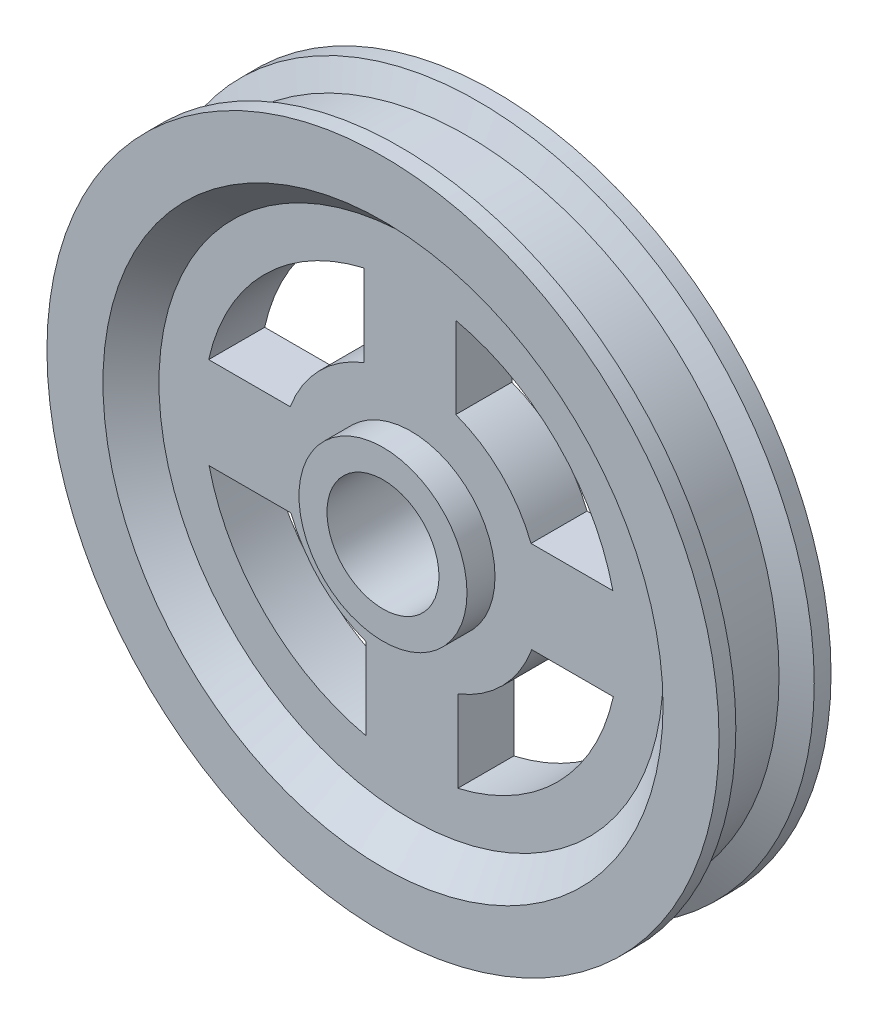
ISO-10303-21;
HEADER;
FILE_DESCRIPTION(('STEP AP214'),'2;1');
FILE_NAME('part.step','',(''),(''),'','','');
FILE_SCHEMA(('AUTOMOTIVE_DESIGN { 1 0 10303 214 1 1 1 1 }'));
ENDSEC;
DATA;
#1=APPLICATION_CONTEXT('core data for automotive mechanical design processes');
#2=APPLICATION_PROTOCOL_DEFINITION('international standard','automotive_design',2000,#1);
#3=PRODUCT_CONTEXT('',#1,'mechanical');
#4=PRODUCT('Part','Part','',(#3));
#5=PRODUCT_RELATED_PRODUCT_CATEGORY('part','',(#4));
#6=PRODUCT_DEFINITION_FORMATION('','',#4);
#7=PRODUCT_DEFINITION_CONTEXT('part definition',#1,'design');
#8=PRODUCT_DEFINITION('design','',#6,#7);
#9=PRODUCT_DEFINITION_SHAPE('','',#8);
#10=(LENGTH_UNIT() NAMED_UNIT(*) SI_UNIT(.MILLI.,.METRE.));
#11=(NAMED_UNIT(*) PLANE_ANGLE_UNIT() SI_UNIT($,.RADIAN.));
#12=(NAMED_UNIT(*) SI_UNIT($,.STERADIAN.) SOLID_ANGLE_UNIT());
#13=UNCERTAINTY_MEASURE_WITH_UNIT(LENGTH_MEASURE(1.E-05),#10,'distance_accuracy_value','');
#14=(GEOMETRIC_REPRESENTATION_CONTEXT(3) GLOBAL_UNCERTAINTY_ASSIGNED_CONTEXT((#13)) GLOBAL_UNIT_ASSIGNED_CONTEXT((#10,
#11,#12)) REPRESENTATION_CONTEXT('',''));
#15=CARTESIAN_POINT('',(0.,0.,0.));
#16=DIRECTION('',(0.,0.,1.));
#17=DIRECTION('',(1.,0.,0.));
#18=AXIS2_PLACEMENT_3D('',#15,#16,#17);
#19=CARTESIAN_POINT('',(0.,15.,10.));
#20=DIRECTION('',(0.,0.,-1.));
#21=DIRECTION('',(-1.,0.,0.));
#22=AXIS2_PLACEMENT_3D('',#19,#20,#21);
#23=PLANE('',#22);
#24=CARTESIAN_POINT('',(0.,0.,10.));
#25=DIRECTION('',(0.,0.,1.));
#26=DIRECTION('',(1.,0.,0.));
#27=AXIS2_PLACEMENT_3D('',#24,#25,#26);
#28=CIRCLE('',#27,10.);
#29=CARTESIAN_POINT('',(10.,0.,10.));
#30=VERTEX_POINT('',#29);
#31=EDGE_CURVE('E11',#30,#30,#28,.T.);
#32=ORIENTED_EDGE('',*,*,#31,.F.);
#33=EDGE_LOOP('',(#32));
#34=FACE_BOUND('',#33,.T.);
#35=CARTESIAN_POINT('',(0.,0.,10.));
#36=DIRECTION('',(0.,0.,1.));
#37=DIRECTION('',(1.,0.,0.));
#38=AXIS2_PLACEMENT_3D('',#35,#36,#37);
#39=CIRCLE('',#38,15.);
#40=CARTESIAN_POINT('',(15.,0.,10.));
#41=VERTEX_POINT('',#40);
#42=EDGE_CURVE('E272',#41,#41,#39,.T.);
#43=ORIENTED_EDGE('',*,*,#42,.T.);
#44=EDGE_LOOP('',(#43));
#45=FACE_BOUND('',#44,.T.);
#46=ADVANCED_FACE('F33',(#34,#45),#23,.F.);
#47=CARTESIAN_POINT('',(0.,0.,25.7403142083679));
#48=DIRECTION('',(0.,0.,1.));
#49=DIRECTION('',(1.,0.,0.));
#50=AXIS2_PLACEMENT_3D('',#47,#48,#49);
#51=CYLINDRICAL_SURFACE('',#50,10.);
#52=CARTESIAN_POINT('',(0.,0.,-10.));
#53=DIRECTION('',(0.,0.,1.));
#54=DIRECTION('',(1.,0.,0.));
#55=AXIS2_PLACEMENT_3D('',#52,#53,#54);
#56=CIRCLE('',#55,10.);
#57=CARTESIAN_POINT('',(10.,0.,-10.));
#58=VERTEX_POINT('',#57);
#59=EDGE_CURVE('E40',#58,#58,#56,.T.);
#60=ORIENTED_EDGE('',*,*,#59,.F.);
#61=EDGE_LOOP('',(#60));
#62=FACE_BOUND('',#61,.T.);
#63=ORIENTED_EDGE('',*,*,#31,.T.);
#64=EDGE_LOOP('',(#63));
#65=FACE_BOUND('',#64,.T.);
#66=ADVANCED_FACE('F324',(#62,#65),#51,.F.);
#67=CARTESIAN_POINT('',(0.,15.,-10.));
#68=DIRECTION('',(0.,0.,1.));
#69=DIRECTION('',(1.,0.,0.));
#70=AXIS2_PLACEMENT_3D('',#67,#68,#69);
#71=PLANE('',#70);
#72=CARTESIAN_POINT('',(0.,0.,-10.));
#73=DIRECTION('',(0.,0.,1.));
#74=DIRECTION('',(1.,0.,0.));
#75=AXIS2_PLACEMENT_3D('',#72,#73,#74);
#76=CIRCLE('',#75,15.);
#77=CARTESIAN_POINT('',(15.,0.,-10.));
#78=VERTEX_POINT('',#77);
#79=EDGE_CURVE('E317',#78,#78,#76,.T.);
#80=ORIENTED_EDGE('',*,*,#79,.F.);
#81=EDGE_LOOP('',(#80));
#82=FACE_BOUND('',#81,.T.);
#83=ORIENTED_EDGE('',*,*,#59,.T.);
#84=EDGE_LOOP('',(#83));
#85=FACE_BOUND('',#84,.T.);
#86=ADVANCED_FACE('F322',(#82,#85),#71,.F.);
#87=CARTESIAN_POINT('',(0.,0.,25.7403142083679));
#88=DIRECTION('',(0.,0.,1.));
#89=DIRECTION('',(1.,0.,0.));
#90=AXIS2_PLACEMENT_3D('',#87,#88,#89);
#91=CYLINDRICAL_SURFACE('',#90,15.);
#92=CARTESIAN_POINT('',(0.,0.,-5.));
#93=DIRECTION('',(0.,0.,1.));
#94=DIRECTION('',(1.,0.,0.));
#95=AXIS2_PLACEMENT_3D('',#92,#93,#94);
#96=CIRCLE('',#95,15.);
#97=CARTESIAN_POINT('',(15.,0.,-5.));
#98=VERTEX_POINT('',#97);
#99=EDGE_CURVE('E314',#98,#98,#96,.T.);
#100=ORIENTED_EDGE('',*,*,#99,.F.);
#101=EDGE_LOOP('',(#100));
#102=FACE_BOUND('',#101,.T.);
#103=ORIENTED_EDGE('',*,*,#79,.T.);
#104=EDGE_LOOP('',(#103));
#105=FACE_BOUND('',#104,.T.);
#106=ADVANCED_FACE('F402',(#102,#105),#91,.T.);
#107=CARTESIAN_POINT('',(0.,15.,-5.));
#108=DIRECTION('',(0.,0.,1.));
#109=DIRECTION('',(1.,0.,0.));
#110=AXIS2_PLACEMENT_3D('',#107,#108,#109);
#111=PLANE('',#110);
#112=DIRECTION('',(1.,0.,0.));
#113=VECTOR('',#112,1.);
#114=CARTESIAN_POINT('',(-36.04423846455,-8.35540983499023,-5.));
#115=LINE('',#114,#113);
#116=CARTESIAN_POINT('',(-36.04423846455,-8.35540983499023,-5.));
#117=VERTEX_POINT('',#116);
#118=CARTESIAN_POINT('',(-21.4286519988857,-8.35540983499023,-5.));
#119=VERTEX_POINT('',#118);
#120=EDGE_CURVE('E175',#117,#119,#115,.T.);
#121=ORIENTED_EDGE('',*,*,#120,.F.);
#122=CARTESIAN_POINT('',(0.,0.,-5.));
#123=DIRECTION('',(0.,0.,-1.));
#124=DIRECTION('',(1.,0.,0.));
#125=AXIS2_PLACEMENT_3D('',#122,#123,#124);
#126=CIRCLE('',#125,37.);
#127=CARTESIAN_POINT('',(-7.99999999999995,-36.1247837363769,-5.));
#128=VERTEX_POINT('',#127);
#129=EDGE_CURVE('E47',#128,#117,#126,.T.);
#130=ORIENTED_EDGE('',*,*,#129,.F.);
#131=DIRECTION('',(0.,-1.,0.));
#132=VECTOR('',#131,1.);
#133=CARTESIAN_POINT('',(-8.,-21.5638586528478,-5.));
#134=LINE('',#133,#132);
#135=CARTESIAN_POINT('',(-8.,-21.5638586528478,-5.));
#136=VERTEX_POINT('',#135);
#137=EDGE_CURVE('E166',#136,#128,#134,.T.);
#138=ORIENTED_EDGE('',*,*,#137,.F.);
#139=CARTESIAN_POINT('',(0.,0.,-5.));
#140=DIRECTION('',(0.,0.,1.));
#141=DIRECTION('',(1.,0.,0.));
#142=AXIS2_PLACEMENT_3D('',#139,#140,#141);
#143=CIRCLE('',#142,23.);
#144=EDGE_CURVE('E169',#119,#136,#143,.T.);
#145=ORIENTED_EDGE('',*,*,#144,.F.);
#146=EDGE_LOOP('',(#121,#130,#138,#145));
#147=FACE_BOUND('',#146,.T.);
#148=DIRECTION('',(0.,1.,0.));
#149=VECTOR('',#148,1.);
#150=CARTESIAN_POINT('',(8.35540983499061,-36.04423846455,-5.));
#151=LINE('',#150,#149);
#152=CARTESIAN_POINT('',(8.35540983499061,-36.04423846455,-5.));
#153=VERTEX_POINT('',#152);
#154=CARTESIAN_POINT('',(8.35540983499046,-21.4286519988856,-5.));
#155=VERTEX_POINT('',#154);
#156=EDGE_CURVE('E201',#153,#155,#151,.T.);
#157=ORIENTED_EDGE('',*,*,#156,.F.);
#158=CARTESIAN_POINT('',(0.,0.,-5.));
#159=DIRECTION('',(0.,0.,-1.));
#160=DIRECTION('',(0.,1.,0.));
#161=AXIS2_PLACEMENT_3D('',#158,#159,#160);
#162=CIRCLE('',#161,37.);
#163=CARTESIAN_POINT('',(36.124783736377,-7.99999999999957,-5.));
#164=VERTEX_POINT('',#163);
#165=EDGE_CURVE('E55',#164,#153,#162,.T.);
#166=ORIENTED_EDGE('',*,*,#165,.F.);
#167=DIRECTION('',(1.,0.,0.));
#168=VECTOR('',#167,1.);
#169=CARTESIAN_POINT('',(21.5638586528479,-7.99999999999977,-5.));
#170=LINE('',#169,#168);
#171=CARTESIAN_POINT('',(21.5638586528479,-7.99999999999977,-5.));
#172=VERTEX_POINT('',#171);
#173=EDGE_CURVE('E190',#172,#164,#170,.T.);
#174=ORIENTED_EDGE('',*,*,#173,.F.);
#175=CARTESIAN_POINT('',(0.,0.,-5.));
#176=DIRECTION('',(0.,0.,1.));
#177=DIRECTION('',(0.,1.,0.));
#178=AXIS2_PLACEMENT_3D('',#175,#176,#177);
#179=CIRCLE('',#178,23.);
#180=EDGE_CURVE('E204',#155,#172,#179,.T.);
#181=ORIENTED_EDGE('',*,*,#180,.F.);
#182=EDGE_LOOP('',(#157,#166,#174,#181));
#183=FACE_BOUND('',#182,.T.);
#184=DIRECTION('',(0.,-1.,0.));
#185=VECTOR('',#184,1.);
#186=CARTESIAN_POINT('',(-8.35540983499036,36.04423846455,-5.));
#187=LINE('',#186,#185);
#188=CARTESIAN_POINT('',(-8.35540983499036,36.04423846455,-5.));
#189=VERTEX_POINT('',#188);
#190=CARTESIAN_POINT('',(-8.35540983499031,21.4286519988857,-5.));
#191=VERTEX_POINT('',#190);
#192=EDGE_CURVE('E230',#189,#191,#187,.T.);
#193=ORIENTED_EDGE('',*,*,#192,.F.);
#194=CARTESIAN_POINT('',(0.,0.,-5.));
#195=DIRECTION('',(0.,0.,-1.));
#196=DIRECTION('',(0.,-1.,0.));
#197=AXIS2_PLACEMENT_3D('',#194,#195,#196);
#198=CIRCLE('',#197,37.);
#199=CARTESIAN_POINT('',(-36.1247837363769,7.99999999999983,-5.));
#200=VERTEX_POINT('',#199);
#201=EDGE_CURVE('E182',#200,#189,#198,.T.);
#202=ORIENTED_EDGE('',*,*,#201,.F.);
#203=DIRECTION('',(-1.,0.,0.));
#204=VECTOR('',#203,1.);
#205=CARTESIAN_POINT('',(-21.5638586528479,7.99999999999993,-5.));
#206=LINE('',#205,#204);
#207=CARTESIAN_POINT('',(-21.5638586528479,7.99999999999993,-5.));
#208=VERTEX_POINT('',#207);
#209=EDGE_CURVE('E219',#208,#200,#206,.T.);
#210=ORIENTED_EDGE('',*,*,#209,.F.);
#211=CARTESIAN_POINT('',(0.,0.,-5.));
#212=DIRECTION('',(0.,0.,1.));
#213=DIRECTION('',(0.,-1.,0.));
#214=AXIS2_PLACEMENT_3D('',#211,#212,#213);
#215=CIRCLE('',#214,23.);
#216=EDGE_CURVE('E233',#191,#208,#215,.T.);
#217=ORIENTED_EDGE('',*,*,#216,.F.);
#218=EDGE_LOOP('',(#193,#202,#210,#217));
#219=FACE_BOUND('',#218,.T.);
#220=DIRECTION('',(-1.,0.,0.));
#221=VECTOR('',#220,1.);
#222=CARTESIAN_POINT('',(36.04423846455,8.35540983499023,-5.));
#223=LINE('',#222,#221);
#224=CARTESIAN_POINT('',(36.04423846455,8.35540983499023,-5.));
#225=VERTEX_POINT('',#224);
#226=CARTESIAN_POINT('',(21.4286519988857,8.35540983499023,-5.));
#227=VERTEX_POINT('',#226);
#228=EDGE_CURVE('E262',#225,#227,#223,.T.);
#229=ORIENTED_EDGE('',*,*,#228,.F.);
#230=CARTESIAN_POINT('',(0.,0.,-5.));
#231=DIRECTION('',(0.,0.,-1.));
#232=DIRECTION('',(-1.,0.,0.));
#233=AXIS2_PLACEMENT_3D('',#230,#231,#232);
#234=CIRCLE('',#233,37.);
#235=CARTESIAN_POINT('',(7.99999999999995,36.1247837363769,-5.));
#236=VERTEX_POINT('',#235);
#237=EDGE_CURVE('E240',#236,#225,#234,.T.);
#238=ORIENTED_EDGE('',*,*,#237,.F.);
#239=DIRECTION('',(0.,1.,0.));
#240=VECTOR('',#239,1.);
#241=CARTESIAN_POINT('',(8.,21.5638586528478,-5.));
#242=LINE('',#241,#240);
#243=CARTESIAN_POINT('',(8.,21.5638586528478,-5.));
#244=VERTEX_POINT('',#243);
#245=EDGE_CURVE('E251',#244,#236,#242,.T.);
#246=ORIENTED_EDGE('',*,*,#245,.F.);
#247=CARTESIAN_POINT('',(0.,0.,-5.));
#248=DIRECTION('',(0.,0.,1.));
#249=DIRECTION('',(-1.,0.,0.));
#250=AXIS2_PLACEMENT_3D('',#247,#248,#249);
#251=CIRCLE('',#250,23.);
#252=EDGE_CURVE('E265',#227,#244,#251,.T.);
#253=ORIENTED_EDGE('',*,*,#252,.F.);
#254=EDGE_LOOP('',(#229,#238,#246,#253));
#255=FACE_BOUND('',#254,.T.);
#256=CARTESIAN_POINT('',(0.,0.,-5.));
#257=DIRECTION('',(0.,0.,1.));
#258=DIRECTION('',(1.,0.,0.));
#259=AXIS2_PLACEMENT_3D('',#256,#257,#258);
#260=CIRCLE('',#259,45.);
#261=CARTESIAN_POINT('',(45.,0.,-5.));
#262=VERTEX_POINT('',#261);
#263=EDGE_CURVE('E311',#262,#262,#260,.T.);
#264=ORIENTED_EDGE('',*,*,#263,.F.);
#265=EDGE_LOOP('',(#264));
#266=FACE_BOUND('',#265,.T.);
#267=ORIENTED_EDGE('',*,*,#99,.T.);
#268=EDGE_LOOP('',(#267));
#269=FACE_BOUND('',#268,.T.);
#270=ADVANCED_FACE('F396',(#147,#183,#219,#255,#266,#269),#111,.F.);
#271=CARTESIAN_POINT('',(0.,0.,-5.));
#272=DIRECTION('',(0.,0.,-1.));
#273=DIRECTION('',(-1.,0.,0.));
#274=AXIS2_PLACEMENT_3D('',#271,#272,#273);
#275=CONICAL_SURFACE('',#274,45.,0.785398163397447);
#276=CARTESIAN_POINT('',(0.,0.,-10.));
#277=DIRECTION('',(0.,0.,1.));
#278=DIRECTION('',(1.,0.,0.));
#279=AXIS2_PLACEMENT_3D('',#276,#277,#278);
#280=CIRCLE('',#279,50.);
#281=CARTESIAN_POINT('',(50.,0.,-10.));
#282=VERTEX_POINT('',#281);
#283=EDGE_CURVE('E308',#282,#282,#280,.T.);
#284=ORIENTED_EDGE('',*,*,#283,.F.);
#285=EDGE_LOOP('',(#284));
#286=FACE_BOUND('',#285,.T.);
#287=ORIENTED_EDGE('',*,*,#263,.T.);
#288=EDGE_LOOP('',(#287));
#289=FACE_BOUND('',#288,.T.);
#290=ADVANCED_FACE('F390',(#286,#289),#275,.F.);
#291=CARTESIAN_POINT('',(0.,50.,-10.));
#292=DIRECTION('',(0.,0.,1.));
#293=DIRECTION('',(1.,0.,0.));
#294=AXIS2_PLACEMENT_3D('',#291,#292,#293);
#295=PLANE('',#294);
#296=CARTESIAN_POINT('',(0.,0.,-10.));
#297=DIRECTION('',(0.,0.,1.));
#298=DIRECTION('',(1.,0.,0.));
#299=AXIS2_PLACEMENT_3D('',#296,#297,#298);
#300=CIRCLE('',#299,60.);
#301=CARTESIAN_POINT('',(60.,0.,-10.));
#302=VERTEX_POINT('',#301);
#303=EDGE_CURVE('E305',#302,#302,#300,.T.);
#304=ORIENTED_EDGE('',*,*,#303,.F.);
#305=EDGE_LOOP('',(#304));
#306=FACE_BOUND('',#305,.T.);
#307=ORIENTED_EDGE('',*,*,#283,.T.);
#308=EDGE_LOOP('',(#307));
#309=FACE_BOUND('',#308,.T.);
#310=ADVANCED_FACE('F384',(#306,#309),#295,.F.);
#311=CARTESIAN_POINT('',(0.,0.,25.7403142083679));
#312=DIRECTION('',(0.,0.,1.));
#313=DIRECTION('',(1.,0.,0.));
#314=AXIS2_PLACEMENT_3D('',#311,#312,#313);
#315=CYLINDRICAL_SURFACE('',#314,60.);
#316=CARTESIAN_POINT('',(0.,0.,-7.00000000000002));
#317=DIRECTION('',(0.,0.,1.));
#318=DIRECTION('',(1.,0.,0.));
#319=AXIS2_PLACEMENT_3D('',#316,#317,#318);
#320=CIRCLE('',#319,60.);
#321=CARTESIAN_POINT('',(60.,0.,-7.00000000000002));
#322=VERTEX_POINT('',#321);
#323=EDGE_CURVE('E302',#322,#322,#320,.T.);
#324=ORIENTED_EDGE('',*,*,#323,.F.);
#325=EDGE_LOOP('',(#324));
#326=FACE_BOUND('',#325,.T.);
#327=ORIENTED_EDGE('',*,*,#303,.T.);
#328=EDGE_LOOP('',(#327));
#329=FACE_BOUND('',#328,.T.);
#330=ADVANCED_FACE('F378',(#326,#329),#315,.T.);
#331=CARTESIAN_POINT('',(0.,0.,-7.00000000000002));
#332=DIRECTION('',(0.,0.,-1.));
#333=DIRECTION('',(-1.,0.,0.));
#334=AXIS2_PLACEMENT_3D('',#331,#332,#333);
#335=CONICAL_SURFACE('',#334,60.,1.13446401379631);
#336=CARTESIAN_POINT('',(0.,0.,-5.));
#337=DIRECTION('',(0.,0.,1.));
#338=DIRECTION('',(1.,0.,0.));
#339=AXIS2_PLACEMENT_3D('',#336,#337,#338);
#340=CIRCLE('',#339,55.7109861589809);
#341=CARTESIAN_POINT('',(55.7109861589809,0.,-5.));
#342=VERTEX_POINT('',#341);
#343=EDGE_CURVE('E299',#342,#342,#340,.T.);
#344=ORIENTED_EDGE('',*,*,#343,.F.);
#345=EDGE_LOOP('',(#344));
#346=FACE_BOUND('',#345,.T.);
#347=ORIENTED_EDGE('',*,*,#323,.T.);
#348=EDGE_LOOP('',(#347));
#349=FACE_BOUND('',#348,.T.);
#350=ADVANCED_FACE('F372',(#346,#349),#335,.T.);
#351=CARTESIAN_POINT('',(0.,0.,25.7403142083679));
#352=DIRECTION('',(0.,0.,1.));
#353=DIRECTION('',(1.,0.,0.));
#354=AXIS2_PLACEMENT_3D('',#351,#352,#353);
#355=CYLINDRICAL_SURFACE('',#354,55.7109861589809);
#356=CARTESIAN_POINT('',(0.,0.,5.));
#357=DIRECTION('',(0.,0.,1.));
#358=DIRECTION('',(1.,0.,0.));
#359=AXIS2_PLACEMENT_3D('',#356,#357,#358);
#360=CIRCLE('',#359,55.7109861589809);
#361=CARTESIAN_POINT('',(55.7109861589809,0.,5.));
#362=VERTEX_POINT('',#361);
#363=EDGE_CURVE('E296',#362,#362,#360,.T.);
#364=ORIENTED_EDGE('',*,*,#363,.F.);
#365=EDGE_LOOP('',(#364));
#366=FACE_BOUND('',#365,.T.);
#367=ORIENTED_EDGE('',*,*,#343,.T.);
#368=EDGE_LOOP('',(#367));
#369=FACE_BOUND('',#368,.T.);
#370=ADVANCED_FACE('F366',(#366,#369),#355,.T.);
#371=CARTESIAN_POINT('',(0.,0.,5.));
#372=DIRECTION('',(0.,0.,1.));
#373=DIRECTION('',(1.,0.,0.));
#374=AXIS2_PLACEMENT_3D('',#371,#372,#373);
#375=CONICAL_SURFACE('',#374,55.7109861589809,1.13446401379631);
#376=CARTESIAN_POINT('',(0.,0.,7.00000000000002));
#377=DIRECTION('',(0.,0.,1.));
#378=DIRECTION('',(1.,0.,0.));
#379=AXIS2_PLACEMENT_3D('',#376,#377,#378);
#380=CIRCLE('',#379,60.);
#381=CARTESIAN_POINT('',(60.,0.,7.00000000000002));
#382=VERTEX_POINT('',#381);
#383=EDGE_CURVE('E293',#382,#382,#380,.T.);
#384=ORIENTED_EDGE('',*,*,#383,.F.);
#385=EDGE_LOOP('',(#384));
#386=FACE_BOUND('',#385,.T.);
#387=ORIENTED_EDGE('',*,*,#363,.T.);
#388=EDGE_LOOP('',(#387));
#389=FACE_BOUND('',#388,.T.);
#390=ADVANCED_FACE('F360',(#386,#389),#375,.T.);
#391=CARTESIAN_POINT('',(0.,0.,25.7403142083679));
#392=DIRECTION('',(0.,0.,1.));
#393=DIRECTION('',(1.,0.,0.));
#394=AXIS2_PLACEMENT_3D('',#391,#392,#393);
#395=CYLINDRICAL_SURFACE('',#394,60.);
#396=CARTESIAN_POINT('',(0.,0.,10.));
#397=DIRECTION('',(0.,0.,1.));
#398=DIRECTION('',(1.,0.,0.));
#399=AXIS2_PLACEMENT_3D('',#396,#397,#398);
#400=CIRCLE('',#399,60.);
#401=CARTESIAN_POINT('',(60.,0.,10.));
#402=VERTEX_POINT('',#401);
#403=EDGE_CURVE('E290',#402,#402,#400,.T.);
#404=ORIENTED_EDGE('',*,*,#403,.F.);
#405=EDGE_LOOP('',(#404));
#406=FACE_BOUND('',#405,.T.);
#407=ORIENTED_EDGE('',*,*,#383,.T.);
#408=EDGE_LOOP('',(#407));
#409=FACE_BOUND('',#408,.T.);
#410=ADVANCED_FACE('F354',(#406,#409),#395,.T.);
#411=CARTESIAN_POINT('',(0.,50.,10.));
#412=DIRECTION('',(0.,0.,-1.));
#413=DIRECTION('',(-1.,0.,0.));
#414=AXIS2_PLACEMENT_3D('',#411,#412,#413);
#415=PLANE('',#414);
#416=CARTESIAN_POINT('',(0.,0.,10.));
#417=DIRECTION('',(0.,0.,1.));
#418=DIRECTION('',(1.,0.,0.));
#419=AXIS2_PLACEMENT_3D('',#416,#417,#418);
#420=CIRCLE('',#419,50.);
#421=CARTESIAN_POINT('',(50.,0.,10.));
#422=VERTEX_POINT('',#421);
#423=EDGE_CURVE('E287',#422,#422,#420,.T.);
#424=ORIENTED_EDGE('',*,*,#423,.F.);
#425=EDGE_LOOP('',(#424));
#426=FACE_BOUND('',#425,.T.);
#427=ORIENTED_EDGE('',*,*,#403,.T.);
#428=EDGE_LOOP('',(#427));
#429=FACE_BOUND('',#428,.T.);
#430=ADVANCED_FACE('F348',(#426,#429),#415,.F.);
#431=CARTESIAN_POINT('',(0.,0.,10.));
#432=DIRECTION('',(0.,0.,1.));
#433=DIRECTION('',(1.,0.,0.));
#434=AXIS2_PLACEMENT_3D('',#431,#432,#433);
#435=CONICAL_SURFACE('',#434,50.,0.785398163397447);
#436=CARTESIAN_POINT('',(0.,0.,5.));
#437=DIRECTION('',(0.,0.,1.));
#438=DIRECTION('',(1.,0.,0.));
#439=AXIS2_PLACEMENT_3D('',#436,#437,#438);
#440=CIRCLE('',#439,45.);
#441=CARTESIAN_POINT('',(45.,0.,5.));
#442=VERTEX_POINT('',#441);
#443=EDGE_CURVE('E284',#442,#442,#440,.T.);
#444=ORIENTED_EDGE('',*,*,#443,.F.);
#445=EDGE_LOOP('',(#444));
#446=FACE_BOUND('',#445,.T.);
#447=ORIENTED_EDGE('',*,*,#423,.T.);
#448=EDGE_LOOP('',(#447));
#449=FACE_BOUND('',#448,.T.);
#450=ADVANCED_FACE('F342',(#446,#449),#435,.F.);
#451=CARTESIAN_POINT('',(0.,15.,5.));
#452=DIRECTION('',(0.,0.,-1.));
#453=DIRECTION('',(-1.,0.,0.));
#454=AXIS2_PLACEMENT_3D('',#451,#452,#453);
#455=PLANE('',#454);
#456=DIRECTION('',(0.,-1.,0.));
#457=VECTOR('',#456,1.);
#458=CARTESIAN_POINT('',(-8.,-21.5638586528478,5.));
#459=LINE('',#458,#457);
#460=CARTESIAN_POINT('',(-8.,-21.5638586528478,5.));
#461=VERTEX_POINT('',#460);
#462=CARTESIAN_POINT('',(-7.99999999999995,-36.1247837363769,5.));
#463=VERTEX_POINT('',#462);
#464=EDGE_CURVE('E153',#461,#463,#459,.T.);
#465=ORIENTED_EDGE('',*,*,#464,.T.);
#466=CARTESIAN_POINT('',(0.,0.,5.));
#467=DIRECTION('',(0.,0.,-1.));
#468=DIRECTION('',(1.,0.,0.));
#469=AXIS2_PLACEMENT_3D('',#466,#467,#468);
#470=CIRCLE('',#469,37.);
#471=CARTESIAN_POINT('',(-36.04423846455,-8.35540983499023,5.));
#472=VERTEX_POINT('',#471);
#473=EDGE_CURVE('E147',#463,#472,#470,.T.);
#474=ORIENTED_EDGE('',*,*,#473,.T.);
#475=DIRECTION('',(1.,0.,0.));
#476=VECTOR('',#475,1.);
#477=CARTESIAN_POINT('',(-36.04423846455,-8.35540983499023,5.));
#478=LINE('',#477,#476);
#479=CARTESIAN_POINT('',(-21.4286519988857,-8.35540983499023,5.));
#480=VERTEX_POINT('',#479);
#481=EDGE_CURVE('E157',#472,#480,#478,.T.);
#482=ORIENTED_EDGE('',*,*,#481,.T.);
#483=CARTESIAN_POINT('',(0.,0.,5.));
#484=DIRECTION('',(0.,0.,1.));
#485=DIRECTION('',(1.,0.,0.));
#486=AXIS2_PLACEMENT_3D('',#483,#484,#485);
#487=CIRCLE('',#486,23.);
#488=EDGE_CURVE('E161',#480,#461,#487,.T.);
#489=ORIENTED_EDGE('',*,*,#488,.T.);
#490=EDGE_LOOP('',(#465,#474,#482,#489));
#491=FACE_BOUND('',#490,.T.);
#492=DIRECTION('',(1.,0.,0.));
#493=VECTOR('',#492,1.);
#494=CARTESIAN_POINT('',(21.5638586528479,-7.99999999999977,5.));
#495=LINE('',#494,#493);
#496=CARTESIAN_POINT('',(21.5638586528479,-7.99999999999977,5.));
#497=VERTEX_POINT('',#496);
#498=CARTESIAN_POINT('',(36.124783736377,-7.99999999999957,5.));
#499=VERTEX_POINT('',#498);
#500=EDGE_CURVE('E196',#497,#499,#495,.T.);
#501=ORIENTED_EDGE('',*,*,#500,.T.);
#502=CARTESIAN_POINT('',(0.,0.,5.));
#503=DIRECTION('',(0.,0.,-1.));
#504=DIRECTION('',(0.,1.,0.));
#505=AXIS2_PLACEMENT_3D('',#502,#503,#504);
#506=CIRCLE('',#505,37.);
#507=CARTESIAN_POINT('',(8.35540983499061,-36.04423846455,5.));
#508=VERTEX_POINT('',#507);
#509=EDGE_CURVE('E186',#499,#508,#506,.T.);
#510=ORIENTED_EDGE('',*,*,#509,.T.);
#511=DIRECTION('',(0.,1.,0.));
#512=VECTOR('',#511,1.);
#513=CARTESIAN_POINT('',(8.35540983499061,-36.04423846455,5.));
#514=LINE('',#513,#512);
#515=CARTESIAN_POINT('',(8.35540983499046,-21.4286519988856,5.));
#516=VERTEX_POINT('',#515);
#517=EDGE_CURVE('E189',#508,#516,#514,.T.);
#518=ORIENTED_EDGE('',*,*,#517,.T.);
#519=CARTESIAN_POINT('',(0.,0.,5.));
#520=DIRECTION('',(0.,0.,1.));
#521=DIRECTION('',(0.,1.,0.));
#522=AXIS2_PLACEMENT_3D('',#519,#520,#521);
#523=CIRCLE('',#522,23.);
#524=EDGE_CURVE('E193',#516,#497,#523,.T.);
#525=ORIENTED_EDGE('',*,*,#524,.T.);
#526=EDGE_LOOP('',(#501,#510,#518,#525));
#527=FACE_BOUND('',#526,.T.);
#528=DIRECTION('',(-1.,0.,0.));
#529=VECTOR('',#528,1.);
#530=CARTESIAN_POINT('',(-21.5638586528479,7.99999999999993,5.));
#531=LINE('',#530,#529);
#532=CARTESIAN_POINT('',(-21.5638586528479,7.99999999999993,5.));
#533=VERTEX_POINT('',#532);
#534=CARTESIAN_POINT('',(-36.1247837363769,7.99999999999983,5.));
#535=VERTEX_POINT('',#534);
#536=EDGE_CURVE('E225',#533,#535,#531,.T.);
#537=ORIENTED_EDGE('',*,*,#536,.T.);
#538=CARTESIAN_POINT('',(0.,0.,5.));
#539=DIRECTION('',(0.,0.,-1.));
#540=DIRECTION('',(0.,-1.,0.));
#541=AXIS2_PLACEMENT_3D('',#538,#539,#540);
#542=CIRCLE('',#541,37.);
#543=CARTESIAN_POINT('',(-8.35540983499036,36.04423846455,5.));
#544=VERTEX_POINT('',#543);
#545=EDGE_CURVE('E215',#535,#544,#542,.T.);
#546=ORIENTED_EDGE('',*,*,#545,.T.);
#547=DIRECTION('',(0.,-1.,0.));
#548=VECTOR('',#547,1.);
#549=CARTESIAN_POINT('',(-8.35540983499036,36.04423846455,5.));
#550=LINE('',#549,#548);
#551=CARTESIAN_POINT('',(-8.35540983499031,21.4286519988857,5.));
#552=VERTEX_POINT('',#551);
#553=EDGE_CURVE('E218',#544,#552,#550,.T.);
#554=ORIENTED_EDGE('',*,*,#553,.T.);
#555=CARTESIAN_POINT('',(0.,0.,5.));
#556=DIRECTION('',(0.,0.,1.));
#557=DIRECTION('',(0.,-1.,0.));
#558=AXIS2_PLACEMENT_3D('',#555,#556,#557);
#559=CIRCLE('',#558,23.);
#560=EDGE_CURVE('E222',#552,#533,#559,.T.);
#561=ORIENTED_EDGE('',*,*,#560,.T.);
#562=EDGE_LOOP('',(#537,#546,#554,#561));
#563=FACE_BOUND('',#562,.T.);
#564=DIRECTION('',(0.,1.,0.));
#565=VECTOR('',#564,1.);
#566=CARTESIAN_POINT('',(8.,21.5638586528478,5.));
#567=LINE('',#566,#565);
#568=CARTESIAN_POINT('',(8.,21.5638586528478,5.));
#569=VERTEX_POINT('',#568);
#570=CARTESIAN_POINT('',(7.99999999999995,36.1247837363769,5.));
#571=VERTEX_POINT('',#570);
#572=EDGE_CURVE('E257',#569,#571,#567,.T.);
#573=ORIENTED_EDGE('',*,*,#572,.T.);
#574=CARTESIAN_POINT('',(0.,0.,5.));
#575=DIRECTION('',(0.,0.,-1.));
#576=DIRECTION('',(-1.,0.,0.));
#577=AXIS2_PLACEMENT_3D('',#574,#575,#576);
#578=CIRCLE('',#577,37.);
#579=CARTESIAN_POINT('',(36.04423846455,8.35540983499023,5.));
#580=VERTEX_POINT('',#579);
#581=EDGE_CURVE('E247',#571,#580,#578,.T.);
#582=ORIENTED_EDGE('',*,*,#581,.T.);
#583=DIRECTION('',(-1.,0.,0.));
#584=VECTOR('',#583,1.);
#585=CARTESIAN_POINT('',(36.04423846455,8.35540983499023,5.));
#586=LINE('',#585,#584);
#587=CARTESIAN_POINT('',(21.4286519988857,8.35540983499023,5.));
#588=VERTEX_POINT('',#587);
#589=EDGE_CURVE('E250',#580,#588,#586,.T.);
#590=ORIENTED_EDGE('',*,*,#589,.T.);
#591=CARTESIAN_POINT('',(0.,0.,5.));
#592=DIRECTION('',(0.,0.,1.));
#593=DIRECTION('',(-1.,0.,0.));
#594=AXIS2_PLACEMENT_3D('',#591,#592,#593);
#595=CIRCLE('',#594,23.);
#596=EDGE_CURVE('E254',#588,#569,#595,.T.);
#597=ORIENTED_EDGE('',*,*,#596,.T.);
#598=EDGE_LOOP('',(#573,#582,#590,#597));
#599=FACE_BOUND('',#598,.T.);
#600=CARTESIAN_POINT('',(0.,0.,5.));
#601=DIRECTION('',(0.,0.,1.));
#602=DIRECTION('',(1.,0.,0.));
#603=AXIS2_PLACEMENT_3D('',#600,#601,#602);
#604=CIRCLE('',#603,15.);
#605=CARTESIAN_POINT('',(15.,0.,5.));
#606=VERTEX_POINT('',#605);
#607=EDGE_CURVE('E281',#606,#606,#604,.T.);
#608=ORIENTED_EDGE('',*,*,#607,.F.);
#609=EDGE_LOOP('',(#608));
#610=FACE_BOUND('',#609,.T.);
#611=ORIENTED_EDGE('',*,*,#443,.T.);
#612=EDGE_LOOP('',(#611));
#613=FACE_BOUND('',#612,.T.);
#614=ADVANCED_FACE('F163',(#491,#527,#563,#599,#610,#613),#455,.F.);
#615=CARTESIAN_POINT('',(0.,0.,25.7403142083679));
#616=DIRECTION('',(0.,0.,1.));
#617=DIRECTION('',(1.,0.,0.));
#618=AXIS2_PLACEMENT_3D('',#615,#616,#617);
#619=CYLINDRICAL_SURFACE('',#618,15.);
#620=ORIENTED_EDGE('',*,*,#42,.F.);
#621=EDGE_LOOP('',(#620));
#622=FACE_BOUND('',#621,.T.);
#623=ORIENTED_EDGE('',*,*,#607,.T.);
#624=EDGE_LOOP('',(#623));
#625=FACE_BOUND('',#624,.T.);
#626=ADVANCED_FACE('F333',(#622,#625),#619,.T.);
#627=CARTESIAN_POINT('',(0.,0.,5.));
#628=DIRECTION('',(0.,0.,-1.));
#629=DIRECTION('',(-1.,0.,0.));
#630=AXIS2_PLACEMENT_3D('',#627,#628,#629);
#631=CYLINDRICAL_SURFACE('',#630,37.);
#632=ORIENTED_EDGE('',*,*,#237,.T.);
#633=DIRECTION('',(0.,0.,-1.));
#634=VECTOR('',#633,1.);
#635=CARTESIAN_POINT('',(36.04423846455,8.35540983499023,5.));
#636=LINE('',#635,#634);
#637=EDGE_CURVE('E260',#580,#225,#636,.T.);
#638=ORIENTED_EDGE('',*,*,#637,.F.);
#639=ORIENTED_EDGE('',*,*,#581,.F.);
#640=DIRECTION('',(0.,0.,-1.));
#641=VECTOR('',#640,1.);
#642=CARTESIAN_POINT('',(7.99999999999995,36.1247837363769,5.));
#643=LINE('',#642,#641);
#644=EDGE_CURVE('E270',#571,#236,#643,.T.);
#645=ORIENTED_EDGE('',*,*,#644,.T.);
#646=EDGE_LOOP('',(#632,#638,#639,#645));
#647=FACE_BOUND('',#646,.T.);
#648=ADVANCED_FACE('F336',(#647),#631,.F.);
#649=CARTESIAN_POINT('',(8.,21.5638586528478,5.));
#650=DIRECTION('',(-1.,0.,0.));
#651=DIRECTION('',(0.,-1.,0.));
#652=AXIS2_PLACEMENT_3D('',#649,#650,#651);
#653=PLANE('',#652);
#654=ORIENTED_EDGE('',*,*,#245,.T.);
#655=ORIENTED_EDGE('',*,*,#644,.F.);
#656=ORIENTED_EDGE('',*,*,#572,.F.);
#657=DIRECTION('',(0.,0.,-1.));
#658=VECTOR('',#657,1.);
#659=CARTESIAN_POINT('',(8.,21.5638586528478,5.));
#660=LINE('',#659,#658);
#661=EDGE_CURVE('E273',#569,#244,#660,.T.);
#662=ORIENTED_EDGE('',*,*,#661,.T.);
#663=EDGE_LOOP('',(#654,#655,#656,#662));
#664=FACE_BOUND('',#663,.T.);
#665=ADVANCED_FACE('F419',(#664),#653,.F.);
#666=CARTESIAN_POINT('',(0.,0.,5.));
#667=DIRECTION('',(0.,0.,-1.));
#668=DIRECTION('',(-1.,0.,0.));
#669=AXIS2_PLACEMENT_3D('',#666,#667,#668);
#670=CYLINDRICAL_SURFACE('',#669,23.);
#671=ORIENTED_EDGE('',*,*,#252,.T.);
#672=ORIENTED_EDGE('',*,*,#661,.F.);
#673=ORIENTED_EDGE('',*,*,#596,.F.);
#674=DIRECTION('',(0.,0.,-1.));
#675=VECTOR('',#674,1.);
#676=CARTESIAN_POINT('',(21.4286519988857,8.35540983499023,5.));
#677=LINE('',#676,#675);
#678=EDGE_CURVE('E275',#588,#227,#677,.T.);
#679=ORIENTED_EDGE('',*,*,#678,.T.);
#680=EDGE_LOOP('',(#671,#672,#673,#679));
#681=FACE_BOUND('',#680,.T.);
#682=ADVANCED_FACE('F425',(#681),#670,.T.);
#683=CARTESIAN_POINT('',(36.04423846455,8.35540983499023,5.));
#684=DIRECTION('',(0.,-1.,0.));
#685=DIRECTION('',(0.,0.,-1.));
#686=AXIS2_PLACEMENT_3D('',#683,#684,#685);
#687=PLANE('',#686);
#688=ORIENTED_EDGE('',*,*,#228,.T.);
#689=ORIENTED_EDGE('',*,*,#678,.F.);
#690=ORIENTED_EDGE('',*,*,#589,.F.);
#691=ORIENTED_EDGE('',*,*,#637,.T.);
#692=EDGE_LOOP('',(#688,#689,#690,#691));
#693=FACE_BOUND('',#692,.T.);
#694=ADVANCED_FACE('F421',(#693),#687,.F.);
#695=CARTESIAN_POINT('',(0.,0.,5.));
#696=DIRECTION('',(0.,0.,-1.));
#697=DIRECTION('',(-1.,0.,0.));
#698=AXIS2_PLACEMENT_3D('',#695,#696,#697);
#699=CYLINDRICAL_SURFACE('',#698,37.);
#700=ORIENTED_EDGE('',*,*,#201,.T.);
#701=DIRECTION('',(0.,0.,-1.));
#702=VECTOR('',#701,1.);
#703=CARTESIAN_POINT('',(-8.35540983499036,36.04423846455,5.));
#704=LINE('',#703,#702);
#705=EDGE_CURVE('E228',#544,#189,#704,.T.);
#706=ORIENTED_EDGE('',*,*,#705,.F.);
#707=ORIENTED_EDGE('',*,*,#545,.F.);
#708=DIRECTION('',(0.,0.,-1.));
#709=VECTOR('',#708,1.);
#710=CARTESIAN_POINT('',(-36.1247837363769,7.99999999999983,5.));
#711=LINE('',#710,#709);
#712=EDGE_CURVE('E238',#535,#200,#711,.T.);
#713=ORIENTED_EDGE('',*,*,#712,.T.);
#714=EDGE_LOOP('',(#700,#706,#707,#713));
#715=FACE_BOUND('',#714,.T.);
#716=ADVANCED_FACE('F424',(#715),#699,.F.);
#717=CARTESIAN_POINT('',(-21.5638586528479,7.99999999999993,5.));
#718=DIRECTION('',(0.,-1.,0.));
#719=DIRECTION('',(1.,0.,0.));
#720=AXIS2_PLACEMENT_3D('',#717,#718,#719);
#721=PLANE('',#720);
#722=ORIENTED_EDGE('',*,*,#209,.T.);
#723=ORIENTED_EDGE('',*,*,#712,.F.);
#724=ORIENTED_EDGE('',*,*,#536,.F.);
#725=DIRECTION('',(0.,0.,-1.));
#726=VECTOR('',#725,1.);
#727=CARTESIAN_POINT('',(-21.5638586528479,7.99999999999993,5.));
#728=LINE('',#727,#726);
#729=EDGE_CURVE('E241',#533,#208,#728,.T.);
#730=ORIENTED_EDGE('',*,*,#729,.T.);
#731=EDGE_LOOP('',(#722,#723,#724,#730));
#732=FACE_BOUND('',#731,.T.);
#733=ADVANCED_FACE('F435',(#732),#721,.F.);
#734=CARTESIAN_POINT('',(0.,0.,5.));
#735=DIRECTION('',(0.,0.,-1.));
#736=DIRECTION('',(-1.,0.,0.));
#737=AXIS2_PLACEMENT_3D('',#734,#735,#736);
#738=CYLINDRICAL_SURFACE('',#737,23.);
#739=ORIENTED_EDGE('',*,*,#216,.T.);
#740=ORIENTED_EDGE('',*,*,#729,.F.);
#741=ORIENTED_EDGE('',*,*,#560,.F.);
#742=DIRECTION('',(0.,0.,-1.));
#743=VECTOR('',#742,1.);
#744=CARTESIAN_POINT('',(-8.35540983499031,21.4286519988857,5.));
#745=LINE('',#744,#743);
#746=EDGE_CURVE('E243',#552,#191,#745,.T.);
#747=ORIENTED_EDGE('',*,*,#746,.T.);
#748=EDGE_LOOP('',(#739,#740,#741,#747));
#749=FACE_BOUND('',#748,.T.);
#750=ADVANCED_FACE('F441',(#749),#738,.T.);
#751=CARTESIAN_POINT('',(-8.35540983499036,36.04423846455,5.));
#752=DIRECTION('',(1.,0.,0.));
#753=DIRECTION('',(0.,1.,0.));
#754=AXIS2_PLACEMENT_3D('',#751,#752,#753);
#755=PLANE('',#754);
#756=ORIENTED_EDGE('',*,*,#192,.T.);
#757=ORIENTED_EDGE('',*,*,#746,.F.);
#758=ORIENTED_EDGE('',*,*,#553,.F.);
#759=ORIENTED_EDGE('',*,*,#705,.T.);
#760=EDGE_LOOP('',(#756,#757,#758,#759));
#761=FACE_BOUND('',#760,.T.);
#762=ADVANCED_FACE('F437',(#761),#755,.F.);
#763=CARTESIAN_POINT('',(0.,0.,5.));
#764=DIRECTION('',(0.,0.,-1.));
#765=DIRECTION('',(-1.,0.,0.));
#766=AXIS2_PLACEMENT_3D('',#763,#764,#765);
#767=CYLINDRICAL_SURFACE('',#766,37.);
#768=ORIENTED_EDGE('',*,*,#165,.T.);
#769=DIRECTION('',(0.,0.,-1.));
#770=VECTOR('',#769,1.);
#771=CARTESIAN_POINT('',(8.35540983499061,-36.04423846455,5.));
#772=LINE('',#771,#770);
#773=EDGE_CURVE('E199',#508,#153,#772,.T.);
#774=ORIENTED_EDGE('',*,*,#773,.F.);
#775=ORIENTED_EDGE('',*,*,#509,.F.);
#776=DIRECTION('',(0.,0.,-1.));
#777=VECTOR('',#776,1.);
#778=CARTESIAN_POINT('',(36.124783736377,-7.99999999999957,5.));
#779=LINE('',#778,#777);
#780=EDGE_CURVE('E176',#499,#164,#779,.T.);
#781=ORIENTED_EDGE('',*,*,#780,.T.);
#782=EDGE_LOOP('',(#768,#774,#775,#781));
#783=FACE_BOUND('',#782,.T.);
#784=ADVANCED_FACE('F440',(#783),#767,.F.);
#785=CARTESIAN_POINT('',(21.5638586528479,-7.99999999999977,5.));
#786=DIRECTION('',(0.,1.,0.));
#787=DIRECTION('',(-1.,0.,0.));
#788=AXIS2_PLACEMENT_3D('',#785,#786,#787);
#789=PLANE('',#788);
#790=ORIENTED_EDGE('',*,*,#173,.T.);
#791=ORIENTED_EDGE('',*,*,#780,.F.);
#792=ORIENTED_EDGE('',*,*,#500,.F.);
#793=DIRECTION('',(0.,0.,-1.));
#794=VECTOR('',#793,1.);
#795=CARTESIAN_POINT('',(21.5638586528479,-7.99999999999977,5.));
#796=LINE('',#795,#794);
#797=EDGE_CURVE('E210',#497,#172,#796,.T.);
#798=ORIENTED_EDGE('',*,*,#797,.T.);
#799=EDGE_LOOP('',(#790,#791,#792,#798));
#800=FACE_BOUND('',#799,.T.);
#801=ADVANCED_FACE('F451',(#800),#789,.F.);
#802=CARTESIAN_POINT('',(0.,0.,5.));
#803=DIRECTION('',(0.,0.,-1.));
#804=DIRECTION('',(-1.,0.,0.));
#805=AXIS2_PLACEMENT_3D('',#802,#803,#804);
#806=CYLINDRICAL_SURFACE('',#805,23.);
#807=ORIENTED_EDGE('',*,*,#180,.T.);
#808=ORIENTED_EDGE('',*,*,#797,.F.);
#809=ORIENTED_EDGE('',*,*,#524,.F.);
#810=DIRECTION('',(0.,0.,-1.));
#811=VECTOR('',#810,1.);
#812=CARTESIAN_POINT('',(8.35540983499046,-21.4286519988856,5.));
#813=LINE('',#812,#811);
#814=EDGE_CURVE('E212',#516,#155,#813,.T.);
#815=ORIENTED_EDGE('',*,*,#814,.T.);
#816=EDGE_LOOP('',(#807,#808,#809,#815));
#817=FACE_BOUND('',#816,.T.);
#818=ADVANCED_FACE('F455',(#817),#806,.T.);
#819=CARTESIAN_POINT('',(8.35540983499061,-36.04423846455,5.));
#820=DIRECTION('',(-1.,0.,0.));
#821=DIRECTION('',(0.,-1.,0.));
#822=AXIS2_PLACEMENT_3D('',#819,#820,#821);
#823=PLANE('',#822);
#824=ORIENTED_EDGE('',*,*,#156,.T.);
#825=ORIENTED_EDGE('',*,*,#814,.F.);
#826=ORIENTED_EDGE('',*,*,#517,.F.);
#827=ORIENTED_EDGE('',*,*,#773,.T.);
#828=EDGE_LOOP('',(#824,#825,#826,#827));
#829=FACE_BOUND('',#828,.T.);
#830=ADVANCED_FACE('F452',(#829),#823,.F.);
#831=CARTESIAN_POINT('',(0.,0.,5.));
#832=DIRECTION('',(0.,0.,-1.));
#833=DIRECTION('',(-1.,0.,0.));
#834=AXIS2_PLACEMENT_3D('',#831,#832,#833);
#835=CYLINDRICAL_SURFACE('',#834,37.);
#836=ORIENTED_EDGE('',*,*,#129,.T.);
#837=DIRECTION('',(0.,0.,-1.));
#838=VECTOR('',#837,1.);
#839=CARTESIAN_POINT('',(-36.04423846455,-8.35540983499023,5.));
#840=LINE('',#839,#838);
#841=EDGE_CURVE('E143',#472,#117,#840,.T.);
#842=ORIENTED_EDGE('',*,*,#841,.F.);
#843=ORIENTED_EDGE('',*,*,#473,.F.);
#844=DIRECTION('',(0.,0.,-1.));
#845=VECTOR('',#844,1.);
#846=CARTESIAN_POINT('',(-7.99999999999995,-36.1247837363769,5.));
#847=LINE('',#846,#845);
#848=EDGE_CURVE('E180',#463,#128,#847,.T.);
#849=ORIENTED_EDGE('',*,*,#848,.T.);
#850=EDGE_LOOP('',(#836,#842,#843,#849));
#851=FACE_BOUND('',#850,.T.);
#852=ADVANCED_FACE('F145',(#851),#835,.F.);
#853=CARTESIAN_POINT('',(-8.,-21.5638586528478,5.));
#854=DIRECTION('',(1.,0.,0.));
#855=DIRECTION('',(0.,1.,0.));
#856=AXIS2_PLACEMENT_3D('',#853,#854,#855);
#857=PLANE('',#856);
#858=ORIENTED_EDGE('',*,*,#137,.T.);
#859=ORIENTED_EDGE('',*,*,#848,.F.);
#860=ORIENTED_EDGE('',*,*,#464,.F.);
#861=DIRECTION('',(0.,0.,-1.));
#862=VECTOR('',#861,1.);
#863=CARTESIAN_POINT('',(-8.,-21.5638586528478,5.));
#864=LINE('',#863,#862);
#865=EDGE_CURVE('E183',#461,#136,#864,.T.);
#866=ORIENTED_EDGE('',*,*,#865,.T.);
#867=EDGE_LOOP('',(#858,#859,#860,#866));
#868=FACE_BOUND('',#867,.T.);
#869=ADVANCED_FACE('F465',(#868),#857,.F.);
#870=CARTESIAN_POINT('',(0.,0.,5.));
#871=DIRECTION('',(0.,0.,-1.));
#872=DIRECTION('',(-1.,0.,0.));
#873=AXIS2_PLACEMENT_3D('',#870,#871,#872);
#874=CYLINDRICAL_SURFACE('',#873,23.);
#875=ORIENTED_EDGE('',*,*,#144,.T.);
#876=ORIENTED_EDGE('',*,*,#865,.F.);
#877=ORIENTED_EDGE('',*,*,#488,.F.);
#878=DIRECTION('',(0.,0.,-1.));
#879=VECTOR('',#878,1.);
#880=CARTESIAN_POINT('',(-21.4286519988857,-8.35540983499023,5.));
#881=LINE('',#880,#879);
#882=EDGE_CURVE('E152',#480,#119,#881,.T.);
#883=ORIENTED_EDGE('',*,*,#882,.T.);
#884=EDGE_LOOP('',(#875,#876,#877,#883));
#885=FACE_BOUND('',#884,.T.);
#886=ADVANCED_FACE('F468',(#885),#874,.T.);
#887=CARTESIAN_POINT('',(-36.04423846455,-8.35540983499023,5.));
#888=DIRECTION('',(0.,1.,0.));
#889=DIRECTION('',(0.,0.,1.));
#890=AXIS2_PLACEMENT_3D('',#887,#888,#889);
#891=PLANE('',#890);
#892=ORIENTED_EDGE('',*,*,#120,.T.);
#893=ORIENTED_EDGE('',*,*,#882,.F.);
#894=ORIENTED_EDGE('',*,*,#481,.F.);
#895=ORIENTED_EDGE('',*,*,#841,.T.);
#896=EDGE_LOOP('',(#892,#893,#894,#895));
#897=FACE_BOUND('',#896,.T.);
#898=ADVANCED_FACE('F158',(#897),#891,.F.);
#899=CLOSED_SHELL('',(#46,#66,#86,#106,#270,#290,#310,#330,#350,#370,#390,#410,#430,#450,#614,
#626,#648,#665,#682,#694,#716,#733,#750,#762,#784,#801,#818,#830,#852,#869,#886,#898));
#900=MANIFOLD_SOLID_BREP('B2',#899);
#901=ADVANCED_BREP_SHAPE_REPRESENTATION('',(#18,#900),#14);
#902=SHAPE_DEFINITION_REPRESENTATION(#9,#901);
ENDSEC;
END-ISO-10303-21;
